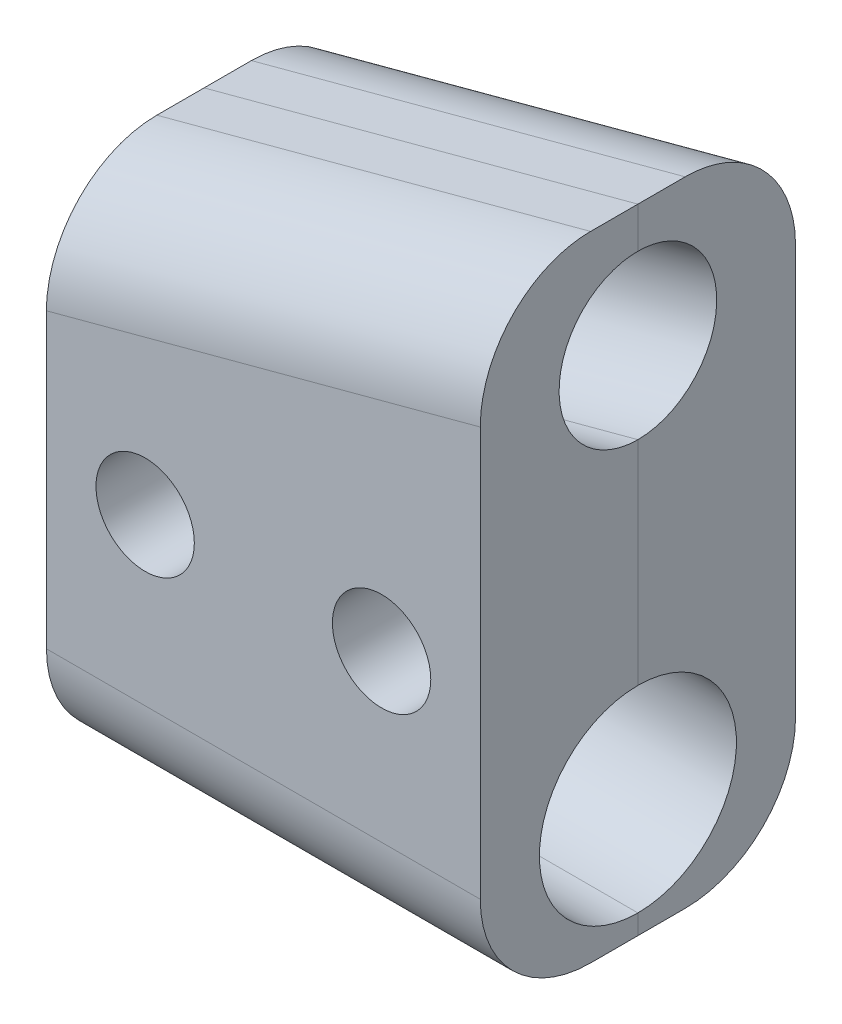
ISO-10303-21;
HEADER;
FILE_DESCRIPTION(('STEP AP214'),'2;1');
FILE_NAME('part.step','',(''),(''),'','','');
FILE_SCHEMA(('AUTOMOTIVE_DESIGN { 1 0 10303 214 1 1 1 1 }'));
ENDSEC;
DATA;
#1=APPLICATION_CONTEXT('core data for automotive mechanical design processes');
#2=APPLICATION_PROTOCOL_DEFINITION('international standard','automotive_design',2000,#1);
#3=PRODUCT_CONTEXT('',#1,'mechanical');
#4=PRODUCT('Part','Part','',(#3));
#5=PRODUCT_RELATED_PRODUCT_CATEGORY('part','',(#4));
#6=PRODUCT_DEFINITION_FORMATION('','',#4);
#7=PRODUCT_DEFINITION_CONTEXT('part definition',#1,'design');
#8=PRODUCT_DEFINITION('design','',#6,#7);
#9=PRODUCT_DEFINITION_SHAPE('','',#8);
#10=(LENGTH_UNIT() NAMED_UNIT(*) SI_UNIT(.MILLI.,.METRE.));
#11=(NAMED_UNIT(*) PLANE_ANGLE_UNIT() SI_UNIT($,.RADIAN.));
#12=(NAMED_UNIT(*) SI_UNIT($,.STERADIAN.) SOLID_ANGLE_UNIT());
#13=UNCERTAINTY_MEASURE_WITH_UNIT(LENGTH_MEASURE(1.E-05),#10,'distance_accuracy_value','');
#14=(GEOMETRIC_REPRESENTATION_CONTEXT(3) GLOBAL_UNCERTAINTY_ASSIGNED_CONTEXT((#13)) GLOBAL_UNIT_ASSIGNED_CONTEXT((#10,
#11,#12)) REPRESENTATION_CONTEXT('',''));
#15=CARTESIAN_POINT('',(0.,0.,0.));
#16=DIRECTION('',(0.,0.,1.));
#17=DIRECTION('',(1.,0.,0.));
#18=AXIS2_PLACEMENT_3D('',#15,#16,#17);
#19=CARTESIAN_POINT('',(0.,0.,0.));
#20=DIRECTION('',(0.,0.,1.));
#21=DIRECTION('',(1.,0.,0.));
#22=AXIS2_PLACEMENT_3D('',#19,#20,#21);
#23=PLANE('',#22);
#24=CARTESIAN_POINT('',(9.525,0.,0.));
#25=DIRECTION('',(0.,0.,1.));
#26=DIRECTION('',(1.,0.,0.));
#27=AXIS2_PLACEMENT_3D('',#24,#25,#26);
#28=CIRCLE('',#27,3.9624);
#29=CARTESIAN_POINT('',(13.4874,0.,0.));
#30=VERTEX_POINT('',#29);
#31=EDGE_CURVE('E212',#30,#30,#28,.T.);
#32=ORIENTED_EDGE('',*,*,#31,.T.);
#33=EDGE_LOOP('',(#32));
#34=FACE_BOUND('',#33,.T.);
#35=CARTESIAN_POINT('',(-9.525,0.,0.));
#36=DIRECTION('',(0.,0.,1.));
#37=DIRECTION('',(1.,0.,0.));
#38=AXIS2_PLACEMENT_3D('',#35,#36,#37);
#39=CIRCLE('',#38,3.9624);
#40=CARTESIAN_POINT('',(-5.5626,0.,0.));
#41=VERTEX_POINT('',#40);
#42=EDGE_CURVE('E204',#41,#41,#39,.T.);
#43=ORIENTED_EDGE('',*,*,#42,.T.);
#44=EDGE_LOOP('',(#43));
#45=FACE_BOUND('',#44,.T.);
#46=DIRECTION('',(0.,-1.,0.));
#47=VECTOR('',#46,1.);
#48=CARTESIAN_POINT('',(-17.4752,19.4533398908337,0.));
#49=LINE('',#48,#47);
#50=CARTESIAN_POINT('',(-17.4752,3.0183305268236,0.));
#51=VERTEX_POINT('',#50);
#52=CARTESIAN_POINT('',(-17.4752,-4.7625,0.));
#53=VERTEX_POINT('',#52);
#54=EDGE_CURVE('E137',#51,#53,#49,.T.);
#55=ORIENTED_EDGE('',*,*,#54,.F.);
#56=DIRECTION('',(0.965925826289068,0.258819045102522,0.));
#57=VECTOR('',#56,1.);
#58=CARTESIAN_POINT('',(-22.8910150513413,1.56716725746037,0.));
#59=LINE('',#58,#57);
#60=CARTESIAN_POINT('',(17.4752,12.3832619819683,0.));
#61=VERTEX_POINT('',#60);
#62=EDGE_CURVE('E122',#51,#61,#59,.T.);
#63=ORIENTED_EDGE('',*,*,#62,.T.);
#64=DIRECTION('',(0.,1.,0.));
#65=VECTOR('',#64,1.);
#66=CARTESIAN_POINT('',(17.4752,-22.225,0.));
#67=LINE('',#66,#65);
#68=CARTESIAN_POINT('',(17.4752,-4.7625,0.));
#69=VERTEX_POINT('',#68);
#70=EDGE_CURVE('E136',#69,#61,#67,.T.);
#71=ORIENTED_EDGE('',*,*,#70,.F.);
#72=DIRECTION('',(1.,0.,0.));
#73=VECTOR('',#72,1.);
#74=CARTESIAN_POINT('',(-25.4,-4.7625,0.));
#75=LINE('',#74,#73);
#76=EDGE_CURVE('E228',#69,#53,#75,.F.);
#77=ORIENTED_EDGE('',*,*,#76,.T.);
#78=EDGE_LOOP('',(#55,#63,#71,#77));
#79=FACE_BOUND('',#78,.T.);
#80=ADVANCED_FACE('F43',(#34,#45,#79),#23,.F.);
#81=CARTESIAN_POINT('',(-17.4752,-20.6375,0.));
#82=VERTEX_POINT('',#81);
#83=CARTESIAN_POINT('',(-17.4752,-22.225,0.));
#84=VERTEX_POINT('',#83);
#85=EDGE_CURVE('E195',#82,#84,#49,.T.);
#86=ORIENTED_EDGE('',*,*,#85,.F.);
#87=DIRECTION('',(1.,0.,0.));
#88=VECTOR('',#87,1.);
#89=CARTESIAN_POINT('',(-25.4,-20.6375,0.));
#90=LINE('',#89,#88);
#91=CARTESIAN_POINT('',(17.4752,-20.6375,0.));
#92=VERTEX_POINT('',#91);
#93=EDGE_CURVE('E224',#82,#92,#90,.T.);
#94=ORIENTED_EDGE('',*,*,#93,.T.);
#95=CARTESIAN_POINT('',(17.4752,-22.225,0.));
#96=VERTEX_POINT('',#95);
#97=EDGE_CURVE('E143',#96,#92,#67,.T.);
#98=ORIENTED_EDGE('',*,*,#97,.F.);
#99=DIRECTION('',(1.,0.,0.));
#100=VECTOR('',#99,1.);
#101=CARTESIAN_POINT('',(-17.4752,-22.225,0.));
#102=LINE('',#101,#100);
#103=EDGE_CURVE('E147',#84,#96,#102,.T.);
#104=ORIENTED_EDGE('',*,*,#103,.F.);
#105=EDGE_LOOP('',(#86,#94,#98,#104));
#106=FACE_BOUND('',#105,.T.);
#107=ADVANCED_FACE('F223',(#106),#23,.F.);
#108=CARTESIAN_POINT('',(0.,0.,12.7));
#109=DIRECTION('',(0.,0.,1.));
#110=DIRECTION('',(1.,0.,0.));
#111=AXIS2_PLACEMENT_3D('',#108,#109,#110);
#112=PLANE('',#111);
#113=CARTESIAN_POINT('',(-9.525,0.,12.7));
#114=DIRECTION('',(0.,0.,1.));
#115=DIRECTION('',(1.,0.,0.));
#116=AXIS2_PLACEMENT_3D('',#113,#114,#115);
#117=CIRCLE('',#116,3.9624);
#118=CARTESIAN_POINT('',(-5.5626,0.,12.7));
#119=VERTEX_POINT('',#118);
#120=EDGE_CURVE('E198',#119,#119,#117,.T.);
#121=ORIENTED_EDGE('',*,*,#120,.F.);
#122=EDGE_LOOP('',(#121));
#123=FACE_BOUND('',#122,.T.);
#124=DIRECTION('',(0.,1.,0.));
#125=VECTOR('',#124,1.);
#126=CARTESIAN_POINT('',(17.4752,-22.225,12.7));
#127=LINE('',#126,#125);
#128=CARTESIAN_POINT('',(17.4752,-13.335,12.7));
#129=VERTEX_POINT('',#128);
#130=CARTESIAN_POINT('',(17.4752,19.6146661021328,12.7));
#131=VERTEX_POINT('',#130);
#132=EDGE_CURVE('E157',#129,#131,#127,.T.);
#133=ORIENTED_EDGE('',*,*,#132,.T.);
#134=DIRECTION('',(-0.965925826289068,-0.258819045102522,0.));
#135=VECTOR('',#134,1.);
#136=CARTESIAN_POINT('',(-15.1742986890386,10.8662592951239,12.7));
#137=LINE('',#136,#135);
#138=CARTESIAN_POINT('',(-17.4752,10.249734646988,12.7));
#139=VERTEX_POINT('',#138);
#140=EDGE_CURVE('E166',#131,#139,#137,.T.);
#141=ORIENTED_EDGE('',*,*,#140,.T.);
#142=DIRECTION('',(0.,-1.,0.));
#143=VECTOR('',#142,1.);
#144=CARTESIAN_POINT('',(-17.4752,19.4533398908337,12.7));
#145=LINE('',#144,#143);
#146=CARTESIAN_POINT('',(-17.4752,-13.335,12.7));
#147=VERTEX_POINT('',#146);
#148=EDGE_CURVE('E153',#139,#147,#145,.T.);
#149=ORIENTED_EDGE('',*,*,#148,.T.);
#150=DIRECTION('',(1.,0.,0.));
#151=VECTOR('',#150,1.);
#152=CARTESIAN_POINT('',(17.4752,-13.335,12.7));
#153=LINE('',#152,#151);
#154=EDGE_CURVE('E129',#147,#129,#153,.T.);
#155=ORIENTED_EDGE('',*,*,#154,.T.);
#156=EDGE_LOOP('',(#133,#141,#149,#155));
#157=FACE_BOUND('',#156,.T.);
#158=CARTESIAN_POINT('',(9.525,0.,12.7));
#159=DIRECTION('',(0.,0.,1.));
#160=DIRECTION('',(1.,0.,0.));
#161=AXIS2_PLACEMENT_3D('',#158,#159,#160);
#162=CIRCLE('',#161,3.9624);
#163=CARTESIAN_POINT('',(13.4874,0.,12.7));
#164=VERTEX_POINT('',#163);
#165=EDGE_CURVE('E209',#164,#164,#162,.T.);
#166=ORIENTED_EDGE('',*,*,#165,.F.);
#167=EDGE_LOOP('',(#166));
#168=FACE_BOUND('',#167,.T.);
#169=ADVANCED_FACE('F179',(#123,#157,#168),#112,.T.);
#170=CARTESIAN_POINT('',(17.4752,25.5312694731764,0.));
#171=VERTEX_POINT('',#170);
#172=CARTESIAN_POINT('',(17.4752,28.8182713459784,0.));
#173=VERTEX_POINT('',#172);
#174=EDGE_CURVE('E144',#171,#173,#67,.T.);
#175=ORIENTED_EDGE('',*,*,#174,.F.);
#176=DIRECTION('',(0.965925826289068,0.258819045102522,0.));
#177=VECTOR('',#176,1.);
#178=CARTESIAN_POINT('',(-26.1780169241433,13.8344252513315,0.));
#179=LINE('',#178,#177);
#180=CARTESIAN_POINT('',(-17.4752,16.1663380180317,0.));
#181=VERTEX_POINT('',#180);
#182=EDGE_CURVE('E125',#171,#181,#179,.F.);
#183=ORIENTED_EDGE('',*,*,#182,.T.);
#184=CARTESIAN_POINT('',(-17.4752,19.4533398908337,0.));
#185=VERTEX_POINT('',#184);
#186=EDGE_CURVE('E193',#185,#181,#49,.T.);
#187=ORIENTED_EDGE('',*,*,#186,.F.);
#188=DIRECTION('',(-0.965925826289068,-0.258819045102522,0.));
#189=VECTOR('',#188,1.);
#190=CARTESIAN_POINT('',(17.4752,28.8182713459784,0.));
#191=LINE('',#190,#189);
#192=EDGE_CURVE('E146',#173,#185,#191,.T.);
#193=ORIENTED_EDGE('',*,*,#192,.F.);
#194=EDGE_LOOP('',(#175,#183,#187,#193));
#195=FACE_BOUND('',#194,.T.);
#196=ADVANCED_FACE('F194',(#195),#23,.F.);
#197=CARTESIAN_POINT('',(-17.4752,19.4533398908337,12.7));
#198=DIRECTION('',(1.,0.,0.));
#199=DIRECTION('',(0.,1.,0.));
#200=AXIS2_PLACEMENT_3D('',#197,#198,#199);
#201=PLANE('',#200);
#202=ORIENTED_EDGE('',*,*,#148,.F.);
#203=CARTESIAN_POINT('',(-17.4752,10.249734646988,3.81));
#204=DIRECTION('',(1.,0.,0.));
#205=DIRECTION('',(0.,1.,0.));
#206=AXIS2_PLACEMENT_3D('',#203,#204,#205);
#207=ELLIPSE('',#206,9.20360524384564,8.89);
#208=CARTESIAN_POINT('',(-17.4752,19.4533398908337,3.81));
#209=VERTEX_POINT('',#208);
#210=EDGE_CURVE('E171',#139,#209,#207,.F.);
#211=ORIENTED_EDGE('',*,*,#210,.T.);
#212=DIRECTION('',(0.,0.,-1.));
#213=VECTOR('',#212,1.);
#214=CARTESIAN_POINT('',(-17.4752,19.4533398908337,12.7));
#215=LINE('',#214,#213);
#216=EDGE_CURVE('E154',#209,#185,#215,.T.);
#217=ORIENTED_EDGE('',*,*,#216,.T.);
#218=ORIENTED_EDGE('',*,*,#186,.T.);
#219=CARTESIAN_POINT('',(-17.4752,9.59233427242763,0.));
#220=DIRECTION('',(1.,0.,0.));
#221=DIRECTION('',(0.,1.,0.));
#222=AXIS2_PLACEMENT_3D('',#219,#220,#221);
#223=ELLIPSE('',#222,6.57400374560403,6.35);
#224=EDGE_CURVE('E138',#181,#51,#223,.T.);
#225=ORIENTED_EDGE('',*,*,#224,.T.);
#226=ORIENTED_EDGE('',*,*,#54,.T.);
#227=CARTESIAN_POINT('',(-17.4752,-12.7,0.));
#228=DIRECTION('',(1.,0.,0.));
#229=DIRECTION('',(0.,1.,0.));
#230=AXIS2_PLACEMENT_3D('',#227,#228,#229);
#231=CIRCLE('',#230,7.9375);
#232=EDGE_CURVE('E227',#53,#82,#231,.T.);
#233=ORIENTED_EDGE('',*,*,#232,.T.);
#234=ORIENTED_EDGE('',*,*,#85,.T.);
#235=DIRECTION('',(0.,0.,-1.));
#236=VECTOR('',#235,1.);
#237=CARTESIAN_POINT('',(-17.4752,-22.225,12.7));
#238=LINE('',#237,#236);
#239=CARTESIAN_POINT('',(-17.4752,-22.225,3.81));
#240=VERTEX_POINT('',#239);
#241=EDGE_CURVE('E161',#240,#84,#238,.T.);
#242=ORIENTED_EDGE('',*,*,#241,.F.);
#243=CARTESIAN_POINT('',(-17.4752,-13.335,3.81));
#244=DIRECTION('',(1.,0.,0.));
#245=DIRECTION('',(0.,1.,0.));
#246=AXIS2_PLACEMENT_3D('',#243,#244,#245);
#247=CIRCLE('',#246,8.89);
#248=EDGE_CURVE('E169',#240,#147,#247,.F.);
#249=ORIENTED_EDGE('',*,*,#248,.T.);
#250=EDGE_LOOP('',(#202,#211,#217,#218,#225,#226,#233,#234,#242,#249));
#251=FACE_BOUND('',#250,.T.);
#252=ADVANCED_FACE('F187',(#251),#201,.F.);
#253=CARTESIAN_POINT('',(-17.4752,-22.225,12.7));
#254=DIRECTION('',(0.,1.,0.));
#255=DIRECTION('',(0.,0.,1.));
#256=AXIS2_PLACEMENT_3D('',#253,#254,#255);
#257=PLANE('',#256);
#258=DIRECTION('',(0.,0.,-1.));
#259=VECTOR('',#258,1.);
#260=CARTESIAN_POINT('',(17.4752,-22.225,12.7));
#261=LINE('',#260,#259);
#262=CARTESIAN_POINT('',(17.4752,-22.225,3.81));
#263=VERTEX_POINT('',#262);
#264=EDGE_CURVE('E159',#263,#96,#261,.T.);
#265=ORIENTED_EDGE('',*,*,#264,.F.);
#266=DIRECTION('',(1.,0.,0.));
#267=VECTOR('',#266,1.);
#268=CARTESIAN_POINT('',(-17.4752,-22.225,3.81));
#269=LINE('',#268,#267);
#270=EDGE_CURVE('E12',#263,#240,#269,.F.);
#271=ORIENTED_EDGE('',*,*,#270,.T.);
#272=ORIENTED_EDGE('',*,*,#241,.T.);
#273=ORIENTED_EDGE('',*,*,#103,.T.);
#274=EDGE_LOOP('',(#265,#271,#272,#273));
#275=FACE_BOUND('',#274,.T.);
#276=ADVANCED_FACE('F219',(#275),#257,.F.);
#277=CARTESIAN_POINT('',(17.4752,-22.225,12.7));
#278=DIRECTION('',(-1.,0.,0.));
#279=DIRECTION('',(0.,0.,1.));
#280=AXIS2_PLACEMENT_3D('',#277,#278,#279);
#281=PLANE('',#280);
#282=DIRECTION('',(0.,0.,-1.));
#283=VECTOR('',#282,1.);
#284=CARTESIAN_POINT('',(17.4752,28.8182713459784,12.7));
#285=LINE('',#284,#283);
#286=CARTESIAN_POINT('',(17.4752,28.8182713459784,3.81));
#287=VERTEX_POINT('',#286);
#288=EDGE_CURVE('E156',#287,#173,#285,.T.);
#289=ORIENTED_EDGE('',*,*,#288,.F.);
#290=CARTESIAN_POINT('',(17.4752,19.6146661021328,3.81));
#291=DIRECTION('',(-1.,0.,0.));
#292=DIRECTION('',(0.,1.,0.));
#293=AXIS2_PLACEMENT_3D('',#290,#291,#292);
#294=ELLIPSE('',#293,9.20360524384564,8.89);
#295=EDGE_CURVE('E51',#287,#131,#294,.F.);
#296=ORIENTED_EDGE('',*,*,#295,.T.);
#297=ORIENTED_EDGE('',*,*,#132,.F.);
#298=CARTESIAN_POINT('',(17.4752,-13.335,3.81));
#299=DIRECTION('',(-1.,0.,0.));
#300=DIRECTION('',(0.,0.,1.));
#301=AXIS2_PLACEMENT_3D('',#298,#299,#300);
#302=CIRCLE('',#301,8.89);
#303=EDGE_CURVE('E58',#129,#263,#302,.F.);
#304=ORIENTED_EDGE('',*,*,#303,.T.);
#305=ORIENTED_EDGE('',*,*,#264,.T.);
#306=ORIENTED_EDGE('',*,*,#97,.T.);
#307=CARTESIAN_POINT('',(17.4752,-12.7,0.));
#308=DIRECTION('',(-1.,0.,0.));
#309=DIRECTION('',(0.,0.,1.));
#310=AXIS2_PLACEMENT_3D('',#307,#308,#309);
#311=CIRCLE('',#310,7.9375);
#312=EDGE_CURVE('E130',#92,#69,#311,.T.);
#313=ORIENTED_EDGE('',*,*,#312,.T.);
#314=ORIENTED_EDGE('',*,*,#70,.T.);
#315=CARTESIAN_POINT('',(17.4752,18.9572657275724,0.));
#316=DIRECTION('',(-1.,0.,0.));
#317=DIRECTION('',(0.,1.,0.));
#318=AXIS2_PLACEMENT_3D('',#315,#316,#317);
#319=ELLIPSE('',#318,6.57400374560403,6.35);
#320=EDGE_CURVE('E119',#61,#171,#319,.T.);
#321=ORIENTED_EDGE('',*,*,#320,.T.);
#322=ORIENTED_EDGE('',*,*,#174,.T.);
#323=EDGE_LOOP('',(#289,#296,#297,#304,#305,#306,#313,#314,#321,#322));
#324=FACE_BOUND('',#323,.T.);
#325=ADVANCED_FACE('F141',(#324),#281,.F.);
#326=CARTESIAN_POINT('',(17.4752,28.8182713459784,12.7));
#327=DIRECTION('',(0.258819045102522,-0.965925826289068,0.));
#328=DIRECTION('',(0.965925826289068,0.258819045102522,0.));
#329=AXIS2_PLACEMENT_3D('',#326,#327,#328);
#330=PLANE('',#329);
#331=ORIENTED_EDGE('',*,*,#216,.F.);
#332=DIRECTION('',(-0.965925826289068,-0.258819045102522,0.));
#333=VECTOR('',#332,1.);
#334=CARTESIAN_POINT('',(17.4752,28.8182713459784,3.81));
#335=LINE('',#334,#333);
#336=EDGE_CURVE('E66',#209,#287,#335,.F.);
#337=ORIENTED_EDGE('',*,*,#336,.T.);
#338=ORIENTED_EDGE('',*,*,#288,.T.);
#339=ORIENTED_EDGE('',*,*,#192,.T.);
#340=EDGE_LOOP('',(#331,#337,#338,#339));
#341=FACE_BOUND('',#340,.T.);
#342=ADVANCED_FACE('F189',(#341),#330,.F.);
#343=CARTESIAN_POINT('',(-9.525,0.,12.7));
#344=DIRECTION('',(0.,0.,-1.));
#345=DIRECTION('',(-1.,0.,0.));
#346=AXIS2_PLACEMENT_3D('',#343,#344,#345);
#347=CYLINDRICAL_SURFACE('',#346,3.9624);
#348=ORIENTED_EDGE('',*,*,#120,.T.);
#349=EDGE_LOOP('',(#348));
#350=FACE_BOUND('',#349,.T.);
#351=ORIENTED_EDGE('',*,*,#42,.F.);
#352=EDGE_LOOP('',(#351));
#353=FACE_BOUND('',#352,.T.);
#354=ADVANCED_FACE('F244',(#350,#353),#347,.F.);
#355=CARTESIAN_POINT('',(9.525,0.,12.7));
#356=DIRECTION('',(0.,0.,-1.));
#357=DIRECTION('',(-1.,0.,0.));
#358=AXIS2_PLACEMENT_3D('',#355,#356,#357);
#359=CYLINDRICAL_SURFACE('',#358,3.9624);
#360=ORIENTED_EDGE('',*,*,#165,.T.);
#361=EDGE_LOOP('',(#360));
#362=FACE_BOUND('',#361,.T.);
#363=ORIENTED_EDGE('',*,*,#31,.F.);
#364=EDGE_LOOP('',(#363));
#365=FACE_BOUND('',#364,.T.);
#366=ADVANCED_FACE('F241',(#362,#365),#359,.F.);
#367=CARTESIAN_POINT('',(-25.4,-12.7,0.));
#368=DIRECTION('',(1.,0.,0.));
#369=DIRECTION('',(0.,0.,-1.));
#370=AXIS2_PLACEMENT_3D('',#367,#368,#369);
#371=CYLINDRICAL_SURFACE('',#370,7.9375);
#372=ORIENTED_EDGE('',*,*,#76,.F.);
#373=ORIENTED_EDGE('',*,*,#312,.F.);
#374=ORIENTED_EDGE('',*,*,#93,.F.);
#375=ORIENTED_EDGE('',*,*,#232,.F.);
#376=EDGE_LOOP('',(#372,#373,#374,#375));
#377=FACE_BOUND('',#376,.T.);
#378=ADVANCED_FACE('F243',(#377),#371,.F.);
#379=CARTESIAN_POINT('',(-24.5345159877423,7.70079625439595,0.));
#380=DIRECTION('',(0.965925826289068,0.258819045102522,0.));
#381=DIRECTION('',(-0.258819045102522,0.965925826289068,0.));
#382=AXIS2_PLACEMENT_3D('',#379,#380,#381);
#383=CYLINDRICAL_SURFACE('',#382,6.35);
#384=ORIENTED_EDGE('',*,*,#182,.F.);
#385=ORIENTED_EDGE('',*,*,#320,.F.);
#386=ORIENTED_EDGE('',*,*,#62,.F.);
#387=ORIENTED_EDGE('',*,*,#224,.F.);
#388=EDGE_LOOP('',(#384,#385,#386,#387));
#389=FACE_BOUND('',#388,.T.);
#390=ADVANCED_FACE('F121',(#389),#383,.F.);
#391=CARTESIAN_POINT('',(-3.73305009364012,13.9319326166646,3.81));
#392=DIRECTION('',(0.965925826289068,0.258819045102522,0.));
#393=DIRECTION('',(-0.258819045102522,0.965925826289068,0.));
#394=AXIS2_PLACEMENT_3D('',#391,#392,#393);
#395=CYLINDRICAL_SURFACE('',#394,8.89);
#396=ORIENTED_EDGE('',*,*,#295,.F.);
#397=ORIENTED_EDGE('',*,*,#336,.F.);
#398=ORIENTED_EDGE('',*,*,#210,.F.);
#399=ORIENTED_EDGE('',*,*,#140,.F.);
#400=EDGE_LOOP('',(#396,#397,#398,#399));
#401=FACE_BOUND('',#400,.T.);
#402=ADVANCED_FACE('F185',(#401),#395,.T.);
#403=CARTESIAN_POINT('',(0.,-13.335,3.81));
#404=DIRECTION('',(-1.,0.,0.));
#405=DIRECTION('',(0.,0.,1.));
#406=AXIS2_PLACEMENT_3D('',#403,#404,#405);
#407=CYLINDRICAL_SURFACE('',#406,8.89);
#408=ORIENTED_EDGE('',*,*,#248,.F.);
#409=ORIENTED_EDGE('',*,*,#270,.F.);
#410=ORIENTED_EDGE('',*,*,#303,.F.);
#411=ORIENTED_EDGE('',*,*,#154,.F.);
#412=EDGE_LOOP('',(#408,#409,#410,#411));
#413=FACE_BOUND('',#412,.T.);
#414=ADVANCED_FACE('F45',(#413),#407,.T.);
#415=CLOSED_SHELL('',(#80,#107,#169,#196,#252,#276,#325,#342,#354,#366,#378,#390,#402,#414));
#416=MANIFOLD_SOLID_BREP('B2',#415);
#417=CARTESIAN_POINT('',(0.,0.,0.));
#418=DIRECTION('',(0.,0.,1.));
#419=DIRECTION('',(1.,0.,0.));
#420=AXIS2_PLACEMENT_3D('',#417,#418,#419);
#421=PLANE('',#420);
#422=DIRECTION('',(0.965925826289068,0.258819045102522,0.));
#423=VECTOR('',#422,1.);
#424=CARTESIAN_POINT('',(-22.8910150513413,1.56716725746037,0.));
#425=LINE('',#424,#423);
#426=CARTESIAN_POINT('',(-17.4752,3.0183305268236,0.));
#427=VERTEX_POINT('',#426);
#428=CARTESIAN_POINT('',(17.4752,12.3832619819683,0.));
#429=VERTEX_POINT('',#428);
#430=EDGE_CURVE('E448',#427,#429,#425,.T.);
#431=ORIENTED_EDGE('',*,*,#430,.F.);
#432=DIRECTION('',(0.,-1.,0.));
#433=VECTOR('',#432,1.);
#434=CARTESIAN_POINT('',(-17.4752,19.4533398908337,0.));
#435=LINE('',#434,#433);
#436=CARTESIAN_POINT('',(-17.4752,-4.7625,0.));
#437=VERTEX_POINT('',#436);
#438=EDGE_CURVE('E459',#427,#437,#435,.T.);
#439=ORIENTED_EDGE('',*,*,#438,.T.);
#440=DIRECTION('',(1.,0.,0.));
#441=VECTOR('',#440,1.);
#442=CARTESIAN_POINT('',(-25.4,-4.7625,0.));
#443=LINE('',#442,#441);
#444=CARTESIAN_POINT('',(17.4752,-4.7625,0.));
#445=VERTEX_POINT('',#444);
#446=EDGE_CURVE('E503',#445,#437,#443,.F.);
#447=ORIENTED_EDGE('',*,*,#446,.F.);
#448=DIRECTION('',(0.,1.,0.));
#449=VECTOR('',#448,1.);
#450=CARTESIAN_POINT('',(17.4752,-22.225,0.));
#451=LINE('',#450,#449);
#452=EDGE_CURVE('E536',#445,#429,#451,.T.);
#453=ORIENTED_EDGE('',*,*,#452,.T.);
#454=EDGE_LOOP('',(#431,#439,#447,#453));
#455=FACE_BOUND('',#454,.T.);
#456=CARTESIAN_POINT('',(-9.525,0.,0.));
#457=DIRECTION('',(0.,0.,1.));
#458=DIRECTION('',(1.,0.,0.));
#459=AXIS2_PLACEMENT_3D('',#456,#457,#458);
#460=CIRCLE('',#459,3.9624);
#461=CARTESIAN_POINT('',(-5.5626,0.,0.));
#462=VERTEX_POINT('',#461);
#463=EDGE_CURVE('E479',#462,#462,#460,.T.);
#464=ORIENTED_EDGE('',*,*,#463,.F.);
#465=EDGE_LOOP('',(#464));
#466=FACE_BOUND('',#465,.T.);
#467=CARTESIAN_POINT('',(9.525,0.,0.));
#468=DIRECTION('',(0.,0.,1.));
#469=DIRECTION('',(1.,0.,0.));
#470=AXIS2_PLACEMENT_3D('',#467,#468,#469);
#471=CIRCLE('',#470,3.9624);
#472=CARTESIAN_POINT('',(13.4874,0.,0.));
#473=VERTEX_POINT('',#472);
#474=EDGE_CURVE('E487',#473,#473,#471,.T.);
#475=ORIENTED_EDGE('',*,*,#474,.F.);
#476=EDGE_LOOP('',(#475));
#477=FACE_BOUND('',#476,.T.);
#478=ADVANCED_FACE('F359',(#455,#466,#477),#421,.T.);
#479=DIRECTION('',(1.,0.,0.));
#480=VECTOR('',#479,1.);
#481=CARTESIAN_POINT('',(-25.4,-20.6375,0.));
#482=LINE('',#481,#480);
#483=CARTESIAN_POINT('',(-17.4752,-20.6375,0.));
#484=VERTEX_POINT('',#483);
#485=CARTESIAN_POINT('',(17.4752,-20.6375,0.));
#486=VERTEX_POINT('',#485);
#487=EDGE_CURVE('E449',#484,#486,#482,.T.);
#488=ORIENTED_EDGE('',*,*,#487,.F.);
#489=CARTESIAN_POINT('',(-17.4752,-22.225,0.));
#490=VERTEX_POINT('',#489);
#491=EDGE_CURVE('E467',#484,#490,#435,.T.);
#492=ORIENTED_EDGE('',*,*,#491,.T.);
#493=DIRECTION('',(1.,0.,0.));
#494=VECTOR('',#493,1.);
#495=CARTESIAN_POINT('',(-17.4752,-22.225,0.));
#496=LINE('',#495,#494);
#497=CARTESIAN_POINT('',(17.4752,-22.225,0.));
#498=VERTEX_POINT('',#497);
#499=EDGE_CURVE('E465',#490,#498,#496,.T.);
#500=ORIENTED_EDGE('',*,*,#499,.T.);
#501=EDGE_CURVE('E534',#498,#486,#451,.T.);
#502=ORIENTED_EDGE('',*,*,#501,.T.);
#503=EDGE_LOOP('',(#488,#492,#500,#502));
#504=FACE_BOUND('',#503,.T.);
#505=ADVANCED_FACE('F533',(#504),#421,.T.);
#506=CARTESIAN_POINT('',(-17.4752,19.4533398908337,-12.7));
#507=DIRECTION('',(-1.,0.,0.));
#508=DIRECTION('',(0.,-1.,0.));
#509=AXIS2_PLACEMENT_3D('',#506,#507,#508);
#510=PLANE('',#509);
#511=DIRECTION('',(0.,0.,1.));
#512=VECTOR('',#511,1.);
#513=CARTESIAN_POINT('',(-17.4752,19.4533398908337,-12.7));
#514=LINE('',#513,#512);
#515=CARTESIAN_POINT('',(-17.4752,19.4533398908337,-3.81));
#516=VERTEX_POINT('',#515);
#517=CARTESIAN_POINT('',(-17.4752,19.4533398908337,0.));
#518=VERTEX_POINT('',#517);
#519=EDGE_CURVE('E506',#516,#518,#514,.T.);
#520=ORIENTED_EDGE('',*,*,#519,.F.);
#521=CARTESIAN_POINT('',(-17.4752,10.249734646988,-3.81));
#522=DIRECTION('',(-1.,0.,0.));
#523=DIRECTION('',(0.,1.,0.));
#524=AXIS2_PLACEMENT_3D('',#521,#522,#523);
#525=ELLIPSE('',#524,9.20360524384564,8.89);
#526=CARTESIAN_POINT('',(-17.4752,10.249734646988,-12.7));
#527=VERTEX_POINT('',#526);
#528=EDGE_CURVE('E514',#516,#527,#525,.T.);
#529=ORIENTED_EDGE('',*,*,#528,.T.);
#530=DIRECTION('',(0.,-1.,0.));
#531=VECTOR('',#530,1.);
#532=CARTESIAN_POINT('',(-17.4752,19.4533398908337,-12.7));
#533=LINE('',#532,#531);
#534=CARTESIAN_POINT('',(-17.4752,-13.335,-12.7));
#535=VERTEX_POINT('',#534);
#536=EDGE_CURVE('E490',#527,#535,#533,.T.);
#537=ORIENTED_EDGE('',*,*,#536,.T.);
#538=CARTESIAN_POINT('',(-17.4752,-13.335,-3.81));
#539=DIRECTION('',(-1.,0.,0.));
#540=DIRECTION('',(0.,-1.,0.));
#541=AXIS2_PLACEMENT_3D('',#538,#539,#540);
#542=CIRCLE('',#541,8.89);
#543=CARTESIAN_POINT('',(-17.4752,-22.225,-3.81));
#544=VERTEX_POINT('',#543);
#545=EDGE_CURVE('E512',#535,#544,#542,.T.);
#546=ORIENTED_EDGE('',*,*,#545,.T.);
#547=DIRECTION('',(0.,0.,1.));
#548=VECTOR('',#547,1.);
#549=CARTESIAN_POINT('',(-17.4752,-22.225,-12.7));
#550=LINE('',#549,#548);
#551=EDGE_CURVE('E493',#544,#490,#550,.T.);
#552=ORIENTED_EDGE('',*,*,#551,.T.);
#553=ORIENTED_EDGE('',*,*,#491,.F.);
#554=CARTESIAN_POINT('',(-17.4752,-12.7,0.));
#555=DIRECTION('',(-1.,0.,0.));
#556=DIRECTION('',(0.,-1.,0.));
#557=AXIS2_PLACEMENT_3D('',#554,#555,#556);
#558=CIRCLE('',#557,7.9375);
#559=EDGE_CURVE('E547',#437,#484,#558,.T.);
#560=ORIENTED_EDGE('',*,*,#559,.F.);
#561=ORIENTED_EDGE('',*,*,#438,.F.);
#562=CARTESIAN_POINT('',(-17.4752,9.59233427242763,0.));
#563=DIRECTION('',(-1.,0.,0.));
#564=DIRECTION('',(0.,1.,0.));
#565=AXIS2_PLACEMENT_3D('',#562,#563,#564);
#566=ELLIPSE('',#565,6.57400374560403,6.35);
#567=CARTESIAN_POINT('',(-17.4752,16.1663380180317,0.));
#568=VERTEX_POINT('',#567);
#569=EDGE_CURVE('E440',#568,#427,#566,.T.);
#570=ORIENTED_EDGE('',*,*,#569,.F.);
#571=EDGE_CURVE('E456',#518,#568,#435,.T.);
#572=ORIENTED_EDGE('',*,*,#571,.F.);
#573=EDGE_LOOP('',(#520,#529,#537,#546,#552,#553,#560,#561,#570,#572));
#574=FACE_BOUND('',#573,.T.);
#575=ADVANCED_FACE('F455',(#574),#510,.T.);
#576=CARTESIAN_POINT('',(17.4752,28.8182713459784,-12.7));
#577=DIRECTION('',(-0.258819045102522,0.965925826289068,0.));
#578=DIRECTION('',(-0.965925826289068,-0.258819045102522,0.));
#579=AXIS2_PLACEMENT_3D('',#576,#577,#578);
#580=PLANE('',#579);
#581=DIRECTION('',(0.,0.,1.));
#582=VECTOR('',#581,1.);
#583=CARTESIAN_POINT('',(17.4752,28.8182713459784,-12.7));
#584=LINE('',#583,#582);
#585=CARTESIAN_POINT('',(17.4752,28.8182713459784,-3.81));
#586=VERTEX_POINT('',#585);
#587=CARTESIAN_POINT('',(17.4752,28.8182713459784,0.));
#588=VERTEX_POINT('',#587);
#589=EDGE_CURVE('E499',#586,#588,#584,.T.);
#590=ORIENTED_EDGE('',*,*,#589,.F.);
#591=DIRECTION('',(-0.965925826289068,-0.258819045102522,0.));
#592=VECTOR('',#591,1.);
#593=CARTESIAN_POINT('',(-17.4752,19.4533398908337,-3.81));
#594=LINE('',#593,#592);
#595=EDGE_CURVE('E509',#586,#516,#594,.T.);
#596=ORIENTED_EDGE('',*,*,#595,.T.);
#597=ORIENTED_EDGE('',*,*,#519,.T.);
#598=DIRECTION('',(-0.965925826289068,-0.258819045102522,0.));
#599=VECTOR('',#598,1.);
#600=CARTESIAN_POINT('',(17.4752,28.8182713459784,0.));
#601=LINE('',#600,#599);
#602=EDGE_CURVE('E464',#588,#518,#601,.T.);
#603=ORIENTED_EDGE('',*,*,#602,.F.);
#604=EDGE_LOOP('',(#590,#596,#597,#603));
#605=FACE_BOUND('',#604,.T.);
#606=ADVANCED_FACE('F524',(#605),#580,.T.);
#607=CARTESIAN_POINT('',(17.4752,-22.225,-12.7));
#608=DIRECTION('',(1.,0.,0.));
#609=DIRECTION('',(0.,0.,-1.));
#610=AXIS2_PLACEMENT_3D('',#607,#608,#609);
#611=PLANE('',#610);
#612=DIRECTION('',(0.,1.,0.));
#613=VECTOR('',#612,1.);
#614=CARTESIAN_POINT('',(17.4752,-22.225,-12.7));
#615=LINE('',#614,#613);
#616=CARTESIAN_POINT('',(17.4752,-13.335,-12.7));
#617=VERTEX_POINT('',#616);
#618=CARTESIAN_POINT('',(17.4752,19.6146661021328,-12.7));
#619=VERTEX_POINT('',#618);
#620=EDGE_CURVE('E492',#617,#619,#615,.T.);
#621=ORIENTED_EDGE('',*,*,#620,.T.);
#622=CARTESIAN_POINT('',(17.4752,19.6146661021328,-3.81));
#623=DIRECTION('',(1.,0.,0.));
#624=DIRECTION('',(0.,1.,0.));
#625=AXIS2_PLACEMENT_3D('',#622,#623,#624);
#626=ELLIPSE('',#625,9.20360524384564,8.89);
#627=EDGE_CURVE('E367',#619,#586,#626,.T.);
#628=ORIENTED_EDGE('',*,*,#627,.T.);
#629=ORIENTED_EDGE('',*,*,#589,.T.);
#630=CARTESIAN_POINT('',(17.4752,25.5312694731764,0.));
#631=VERTEX_POINT('',#630);
#632=EDGE_CURVE('E469',#631,#588,#451,.T.);
#633=ORIENTED_EDGE('',*,*,#632,.F.);
#634=CARTESIAN_POINT('',(17.4752,18.9572657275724,0.));
#635=DIRECTION('',(1.,0.,0.));
#636=DIRECTION('',(0.,1.,0.));
#637=AXIS2_PLACEMENT_3D('',#634,#635,#636);
#638=ELLIPSE('',#637,6.57400374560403,6.35);
#639=EDGE_CURVE('E443',#429,#631,#638,.T.);
#640=ORIENTED_EDGE('',*,*,#639,.F.);
#641=ORIENTED_EDGE('',*,*,#452,.F.);
#642=CARTESIAN_POINT('',(17.4752,-12.7,0.));
#643=DIRECTION('',(1.,0.,0.));
#644=DIRECTION('',(0.,0.,-1.));
#645=AXIS2_PLACEMENT_3D('',#642,#643,#644);
#646=CIRCLE('',#645,7.9375);
#647=EDGE_CURVE('E460',#486,#445,#646,.T.);
#648=ORIENTED_EDGE('',*,*,#647,.F.);
#649=ORIENTED_EDGE('',*,*,#501,.F.);
#650=DIRECTION('',(0.,0.,1.));
#651=VECTOR('',#650,1.);
#652=CARTESIAN_POINT('',(17.4752,-22.225,-12.7));
#653=LINE('',#652,#651);
#654=CARTESIAN_POINT('',(17.4752,-22.225,-3.81));
#655=VERTEX_POINT('',#654);
#656=EDGE_CURVE('E496',#655,#498,#653,.T.);
#657=ORIENTED_EDGE('',*,*,#656,.F.);
#658=CARTESIAN_POINT('',(17.4752,-13.335,-3.81));
#659=DIRECTION('',(1.,0.,0.));
#660=DIRECTION('',(0.,0.,-1.));
#661=AXIS2_PLACEMENT_3D('',#658,#659,#660);
#662=CIRCLE('',#661,8.89);
#663=EDGE_CURVE('E374',#655,#617,#662,.T.);
#664=ORIENTED_EDGE('',*,*,#663,.T.);
#665=EDGE_LOOP('',(#621,#628,#629,#633,#640,#641,#648,#649,#657,#664));
#666=FACE_BOUND('',#665,.T.);
#667=ADVANCED_FACE('F520',(#666),#611,.T.);
#668=CARTESIAN_POINT('',(-17.4752,-22.225,-12.7));
#669=DIRECTION('',(0.,-1.,0.));
#670=DIRECTION('',(0.,0.,-1.));
#671=AXIS2_PLACEMENT_3D('',#668,#669,#670);
#672=PLANE('',#671);
#673=ORIENTED_EDGE('',*,*,#551,.F.);
#674=DIRECTION('',(1.,0.,0.));
#675=VECTOR('',#674,1.);
#676=CARTESIAN_POINT('',(17.4752,-22.225,-3.81));
#677=LINE('',#676,#675);
#678=EDGE_CURVE('E41',#544,#655,#677,.T.);
#679=ORIENTED_EDGE('',*,*,#678,.T.);
#680=ORIENTED_EDGE('',*,*,#656,.T.);
#681=ORIENTED_EDGE('',*,*,#499,.F.);
#682=EDGE_LOOP('',(#673,#679,#680,#681));
#683=FACE_BOUND('',#682,.T.);
#684=ADVANCED_FACE('F529',(#683),#672,.T.);
#685=CARTESIAN_POINT('',(0.,0.,-12.7));
#686=DIRECTION('',(0.,0.,1.));
#687=DIRECTION('',(1.,0.,0.));
#688=AXIS2_PLACEMENT_3D('',#685,#686,#687);
#689=PLANE('',#688);
#690=CARTESIAN_POINT('',(9.525,0.,-12.7));
#691=DIRECTION('',(0.,0.,1.));
#692=DIRECTION('',(1.,0.,0.));
#693=AXIS2_PLACEMENT_3D('',#690,#691,#692);
#694=CIRCLE('',#693,3.9624);
#695=CARTESIAN_POINT('',(13.4874,0.,-12.7));
#696=VERTEX_POINT('',#695);
#697=EDGE_CURVE('E484',#696,#696,#694,.T.);
#698=ORIENTED_EDGE('',*,*,#697,.T.);
#699=EDGE_LOOP('',(#698));
#700=FACE_BOUND('',#699,.T.);
#701=CARTESIAN_POINT('',(-9.525,0.,-12.7));
#702=DIRECTION('',(0.,0.,1.));
#703=DIRECTION('',(1.,0.,0.));
#704=AXIS2_PLACEMENT_3D('',#701,#702,#703);
#705=CIRCLE('',#704,3.9624);
#706=CARTESIAN_POINT('',(-5.5626,0.,-12.7));
#707=VERTEX_POINT('',#706);
#708=EDGE_CURVE('E473',#707,#707,#705,.T.);
#709=ORIENTED_EDGE('',*,*,#708,.T.);
#710=EDGE_LOOP('',(#709));
#711=FACE_BOUND('',#710,.T.);
#712=ORIENTED_EDGE('',*,*,#536,.F.);
#713=DIRECTION('',(-0.965925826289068,-0.258819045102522,0.));
#714=VECTOR('',#713,1.);
#715=CARTESIAN_POINT('',(19.7761013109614,20.2311907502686,-12.7));
#716=LINE('',#715,#714);
#717=EDGE_CURVE('E381',#527,#619,#716,.F.);
#718=ORIENTED_EDGE('',*,*,#717,.T.);
#719=ORIENTED_EDGE('',*,*,#620,.F.);
#720=DIRECTION('',(1.,0.,0.));
#721=VECTOR('',#720,1.);
#722=CARTESIAN_POINT('',(-17.4752,-13.335,-12.7));
#723=LINE('',#722,#721);
#724=EDGE_CURVE('E516',#617,#535,#723,.F.);
#725=ORIENTED_EDGE('',*,*,#724,.T.);
#726=EDGE_LOOP('',(#712,#718,#719,#725));
#727=FACE_BOUND('',#726,.T.);
#728=ADVANCED_FACE('F527',(#700,#711,#727),#689,.F.);
#729=DIRECTION('',(0.965925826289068,0.258819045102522,0.));
#730=VECTOR('',#729,1.);
#731=CARTESIAN_POINT('',(-26.1780169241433,13.8344252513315,0.));
#732=LINE('',#731,#730);
#733=EDGE_CURVE('E437',#631,#568,#732,.F.);
#734=ORIENTED_EDGE('',*,*,#733,.F.);
#735=ORIENTED_EDGE('',*,*,#632,.T.);
#736=ORIENTED_EDGE('',*,*,#602,.T.);
#737=ORIENTED_EDGE('',*,*,#571,.T.);
#738=EDGE_LOOP('',(#734,#735,#736,#737));
#739=FACE_BOUND('',#738,.T.);
#740=ADVANCED_FACE('F462',(#739),#421,.T.);
#741=CARTESIAN_POINT('',(-9.525,0.,-12.7));
#742=DIRECTION('',(0.,0.,1.));
#743=DIRECTION('',(1.,0.,0.));
#744=AXIS2_PLACEMENT_3D('',#741,#742,#743);
#745=CYLINDRICAL_SURFACE('',#744,3.9624);
#746=ORIENTED_EDGE('',*,*,#708,.F.);
#747=EDGE_LOOP('',(#746));
#748=FACE_BOUND('',#747,.T.);
#749=ORIENTED_EDGE('',*,*,#463,.T.);
#750=EDGE_LOOP('',(#749));
#751=FACE_BOUND('',#750,.T.);
#752=ADVANCED_FACE('F558',(#748,#751),#745,.F.);
#753=CARTESIAN_POINT('',(9.525,0.,-12.7));
#754=DIRECTION('',(0.,0.,1.));
#755=DIRECTION('',(1.,0.,0.));
#756=AXIS2_PLACEMENT_3D('',#753,#754,#755);
#757=CYLINDRICAL_SURFACE('',#756,3.9624);
#758=ORIENTED_EDGE('',*,*,#697,.F.);
#759=EDGE_LOOP('',(#758));
#760=FACE_BOUND('',#759,.T.);
#761=ORIENTED_EDGE('',*,*,#474,.T.);
#762=EDGE_LOOP('',(#761));
#763=FACE_BOUND('',#762,.T.);
#764=ADVANCED_FACE('F555',(#760,#763),#757,.F.);
#765=CARTESIAN_POINT('',(-25.4,-12.7,0.));
#766=DIRECTION('',(1.,0.,0.));
#767=DIRECTION('',(0.,0.,-1.));
#768=AXIS2_PLACEMENT_3D('',#765,#766,#767);
#769=CYLINDRICAL_SURFACE('',#768,7.9375);
#770=ORIENTED_EDGE('',*,*,#487,.T.);
#771=ORIENTED_EDGE('',*,*,#647,.T.);
#772=ORIENTED_EDGE('',*,*,#446,.T.);
#773=ORIENTED_EDGE('',*,*,#559,.T.);
#774=EDGE_LOOP('',(#770,#771,#772,#773));
#775=FACE_BOUND('',#774,.T.);
#776=ADVANCED_FACE('F546',(#775),#769,.F.);
#777=CARTESIAN_POINT('',(-24.5345159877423,7.70079625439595,0.));
#778=DIRECTION('',(0.965925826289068,0.258819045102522,0.));
#779=DIRECTION('',(-0.258819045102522,0.965925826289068,0.));
#780=AXIS2_PLACEMENT_3D('',#777,#778,#779);
#781=CYLINDRICAL_SURFACE('',#780,6.35);
#782=ORIENTED_EDGE('',*,*,#430,.T.);
#783=ORIENTED_EDGE('',*,*,#639,.T.);
#784=ORIENTED_EDGE('',*,*,#733,.T.);
#785=ORIENTED_EDGE('',*,*,#569,.T.);
#786=EDGE_LOOP('',(#782,#783,#784,#785));
#787=FACE_BOUND('',#786,.T.);
#788=ADVANCED_FACE('F439',(#787),#781,.F.);
#789=CARTESIAN_POINT('',(19.7761013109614,20.2311907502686,-3.81));
#790=DIRECTION('',(0.965925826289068,0.258819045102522,0.));
#791=DIRECTION('',(-0.258819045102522,0.965925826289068,0.));
#792=AXIS2_PLACEMENT_3D('',#789,#790,#791);
#793=CYLINDRICAL_SURFACE('',#792,8.89);
#794=ORIENTED_EDGE('',*,*,#627,.F.);
#795=ORIENTED_EDGE('',*,*,#717,.F.);
#796=ORIENTED_EDGE('',*,*,#528,.F.);
#797=ORIENTED_EDGE('',*,*,#595,.F.);
#798=EDGE_LOOP('',(#794,#795,#796,#797));
#799=FACE_BOUND('',#798,.T.);
#800=ADVANCED_FACE('F525',(#799),#793,.T.);
#801=CARTESIAN_POINT('',(-17.4752,-13.335,-3.81));
#802=DIRECTION('',(-1.,0.,0.));
#803=DIRECTION('',(0.,0.,1.));
#804=AXIS2_PLACEMENT_3D('',#801,#802,#803);
#805=CYLINDRICAL_SURFACE('',#804,8.89);
#806=ORIENTED_EDGE('',*,*,#545,.F.);
#807=ORIENTED_EDGE('',*,*,#724,.F.);
#808=ORIENTED_EDGE('',*,*,#663,.F.);
#809=ORIENTED_EDGE('',*,*,#678,.F.);
#810=EDGE_LOOP('',(#806,#807,#808,#809));
#811=FACE_BOUND('',#810,.T.);
#812=ADVANCED_FACE('F361',(#811),#805,.T.);
#813=CLOSED_SHELL('',(#478,#505,#575,#606,#667,#684,#728,#740,#752,#764,#776,#788,#800,#812));
#814=MANIFOLD_SOLID_BREP('B6',#813);
#815=ADVANCED_BREP_SHAPE_REPRESENTATION('',(#18,#416,#814),#14);
#816=SHAPE_DEFINITION_REPRESENTATION(#9,#815);
ENDSEC;
END-ISO-10303-21;
